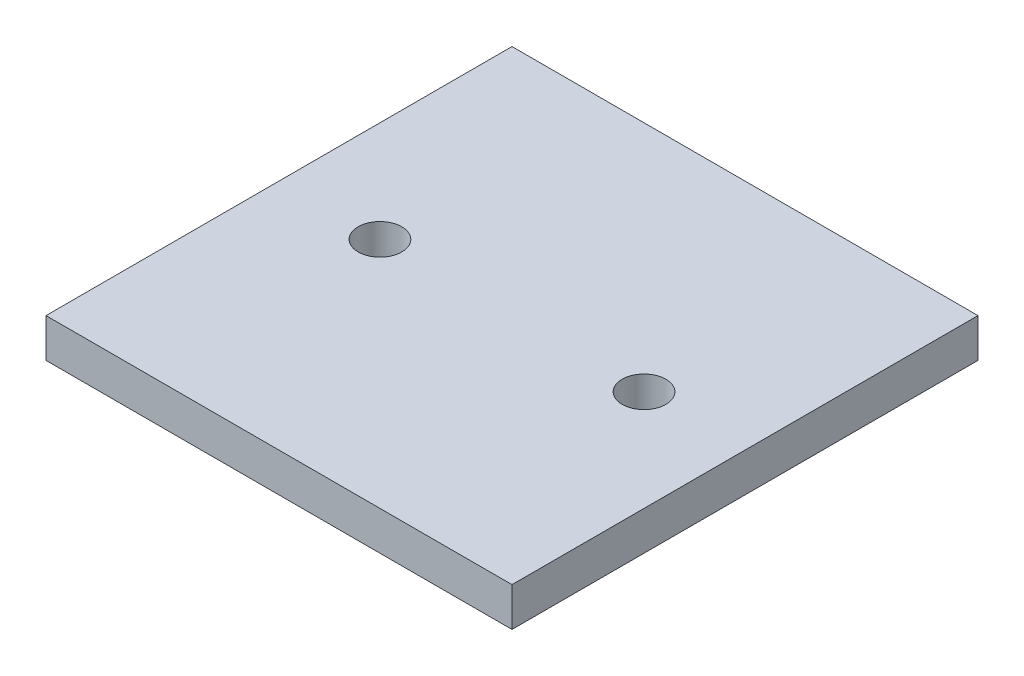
from build123d import *

# Parameters (mm, degrees)
SKETCH1_W           = 152.4
SKETCH1_H           = 152.4
BOSS_EXTRUDE1_DEPTH = 12.7
SKETCH2_R           = 7.14375
CUT_EXTRUDE1_DEPTH  = 25.4


with BuildPart() as part:
    # Sketch1 → Boss-Extrude1 (new body)
    with BuildSketch(Plane(origin=(0, 0, 0), x_dir=(1, 0, 0), z_dir=(0, 1, 0))):
        Rectangle(SKETCH1_W, SKETCH1_H)
    extrude(amount=BOSS_EXTRUDE1_DEPTH)

    # Sketch2 → Cut-Extrude1 (cut)
    with BuildSketch(Plane(origin=(0, 0, 0), x_dir=(1, 0, 0), z_dir=(0, 1, 0))):
        with Locations(Location((-43.18, 0, 0), (0, 0, 270))):
            Circle(SKETCH2_R)
        with Locations(Location((43.18, 0, 0), (0, 0, 270))):
            Circle(SKETCH2_R)
    extrude(amount=CUT_EXTRUDE1_DEPTH, mode=Mode.SUBTRACT)


solid = part.part
